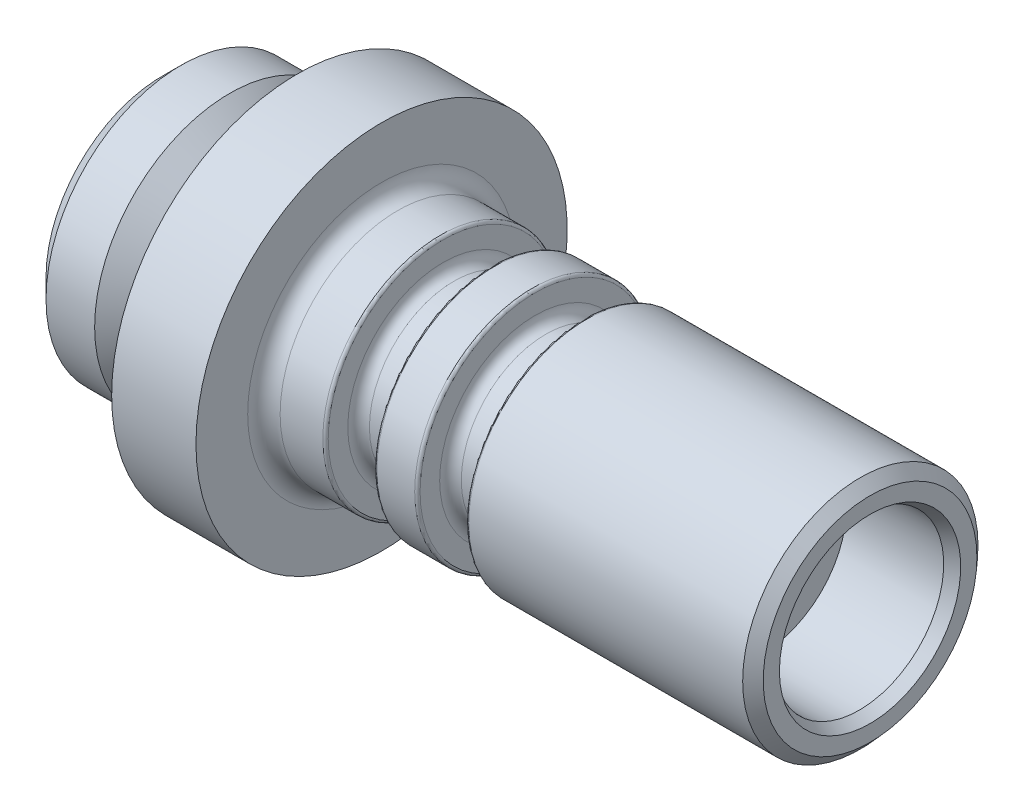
from build123d import *

# Parameters (mm, degrees)
SKETCH1_R          = 8.7249
BASE_EXTRUDE_DEPTH = 33.274
SKETCH3_R          = 2.7051
CUT_EXTRUDE1_DEPTH = 36.488122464
SKETCH4_W          = 22.9616
SKETCH4_H          = 3.19405
FILLET1_R          = 0.762
CHAMFER1_SIZE      = 0.508
CHAMFER1_SIZE2     = 0.457405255
CHAMFER2_SIZE      = 0.508
CHAMFER2_SIZE2     = 0.457405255


with BuildPart() as part:
    # Sketch1 → Base-Extrude (new body)
    with BuildSketch(Plane(origin=(0, 0, 0), x_dir=(0, 0, -1), z_dir=(1, 0, 0))):
        Circle(SKETCH1_R)
    extrude(amount=BASE_EXTRUDE_DEPTH)

    # Sketch2 → Cut-Revolve1 (revolve, cut)
    with BuildSketch(Plane.XY, mode=Mode.PRIVATE) as cut_revolve1_sk:
        Polygon((0, 5.461), (0.889, 6.35), (3.175, 6.35), (4.064, 5.461), (6.35, 5.461), (6.35, 8.7249), (0, 8.7249), align=None)
    revolve(cut_revolve1_sk.sketch.rotate(Axis((0, 0, 0), (1, 0, 0)), 90), axis=Axis((0, 0, 0), (1, 0, 0)), mode=Mode.SUBTRACT)

    # Sketch3 → Cut-Extrude1 (cut, through all)
    with BuildSketch(Plane(origin=(0, 0, 0), x_dir=(0, 0, -1), z_dir=(1, 0, 0))):
        Circle(SKETCH3_R)
    extrude(amount=CUT_EXTRUDE1_DEPTH, mode=Mode.SUBTRACT)

    # Sketch4 → Cut-Revolve2 (revolve, cut)
    with BuildSketch(Plane.XY, mode=Mode.PRIVATE) as cut_revolve2_sk:
        with Locations((21.7932, 7.127875)):
            Rectangle(SKETCH4_W, SKETCH4_H)
    revolve(cut_revolve2_sk.sketch.rotate(Axis((0, 0, 0), (1, 0, 0)), 90), axis=Axis((0, 0, 0), (1, 0, 0)), mode=Mode.SUBTRACT)

    # Fillet1
    fillet1_edges = [part.edges().sort_by_distance(p)[0] for p in [
        (10.3124, 0, -5.53085),
        (6.35, 0, -5.461),
    ]]
    fillet(fillet1_edges, radius=FILLET1_R)

    # Sketch5 → Cut-Revolve3 (revolve, cut)
    with BuildSketch(Plane.XY, mode=Mode.PRIVATE) as cut_revolve3_sk:
        with BuildLine():
            Line((17.399, 5.53085), (19.939, 5.53085))
            ThreePointArc((19.939, 5.53085), (19.849197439, 5.493652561), (19.812, 5.40385))
            Line((19.812, 5.40385), (19.812, 4.4831))
            ThreePointArc((19.812, 4.4831), (19.663210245, 4.123889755), (19.304, 3.9751))
            Line((19.304, 3.9751), (18.034, 3.9751))
            ThreePointArc((18.034, 3.9751), (17.674789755, 4.123889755), (17.526, 4.4831))
            Line((17.526, 4.4831), (17.526, 5.40385))
            ThreePointArc((17.526, 5.40385), (17.488802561, 5.493652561), (17.399, 5.53085))
        make_face()
        with BuildLine():
            Line((13.081, 5.53085), (15.621, 5.53085))
            ThreePointArc((15.621, 5.53085), (15.531197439, 5.493652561), (15.494, 5.40385))
            Line((15.494, 5.40385), (15.494, 4.4831))
            ThreePointArc((15.494, 4.4831), (15.345210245, 4.123889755), (14.986, 3.9751))
            Line((14.986, 3.9751), (13.716, 3.9751))
            ThreePointArc((13.716, 3.9751), (13.356789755, 4.123889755), (13.208, 4.4831))
            Line((13.208, 4.4831), (13.208, 5.40385))
            ThreePointArc((13.208, 5.40385), (13.170802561, 5.493652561), (13.081, 5.53085))
        make_face()
    revolve(cut_revolve3_sk.sketch.rotate(Axis((0, 0, 0), (1, 0, 0)), 90), axis=Axis((0, 0, 0), (1, 0, 0)), mode=Mode.SUBTRACT)

    # Chamfer1
    chamfer1_edges = [part.edges().sort_by_distance(p)[0] for p in [
        (33.274, 0, -5.53085),
    ]]
    chamfer1_side = [part.faces().sort_by_distance(p)[0] for p in [
        (33.274, 0, -5.374413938),
    ]]
    chamfer(chamfer1_edges, length=CHAMFER1_SIZE, length2=CHAMFER1_SIZE2, reference=chamfer1_side[0])

    # Sketch6 → Cut-Revolve4 (revolve, cut)
    with BuildSketch(Plane.XY, mode=Mode.PRIVATE) as cut_revolve4_sk:
        Polygon((33.274, 4.262043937), (32.766, 3.96875), (28.194, 3.96875), (28.194, 0), (33.274, 0), align=None)
    revolve(cut_revolve4_sk.sketch.rotate(Axis((23.780461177, 0, 0), (1, 0, 0)), 270), axis=Axis((23.780461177, 0, 0), (1, 0, 0)), mode=Mode.SUBTRACT)

    # Sketch7 → Cut-Revolve5 (revolve, cut)
    with BuildSketch(Plane.XY, mode=Mode.PRIVATE) as cut_revolve5_sk:
        Polygon((0, 3.9751), (8.89, 3.9751), (13.462829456, 0), (0, 0), align=None)
    revolve(cut_revolve5_sk.sketch.rotate(Axis((9.057151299, 0, 0), (-1, 0, 0)), 270), axis=Axis((9.057151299, 0, 0), (-1, 0, 0)), mode=Mode.SUBTRACT)

    # Chamfer2
    chamfer2_edges = [part.edges().sort_by_distance(p)[0] for p in [
        (0, 0, -3.9751),
    ]]
    chamfer2_side = [part.faces().sort_by_distance(p)[0] for p in [
        (4.445, 0, -3.9751),
    ]]
    chamfer(chamfer2_edges, length=CHAMFER2_SIZE, length2=CHAMFER2_SIZE2, reference=chamfer2_side[0])


solid = part.part
